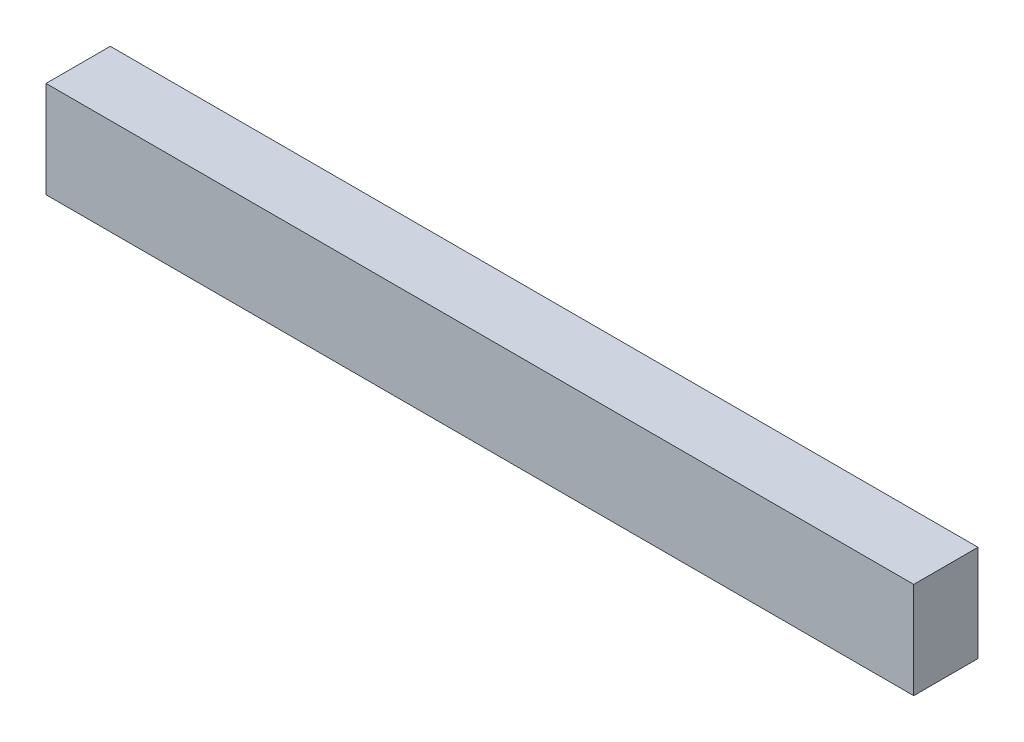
from build123d import *

# Parameters (mm, degrees)
ESQUISSE1_W      = 20
ESQUISSE1_H      = 30
EXTRUSION1_DEPTH = 270


with BuildPart() as part:
    # Esquisse1 → Extrusion1 (new body)
    with BuildSketch(Plane(origin=(0, 0, 0), x_dir=(0, 0, -1), z_dir=(1, 0, 0))):
        with Locations((10, 15)):
            Rectangle(ESQUISSE1_W, ESQUISSE1_H)
    extrude(amount=EXTRUSION1_DEPTH)


solid = part.part
